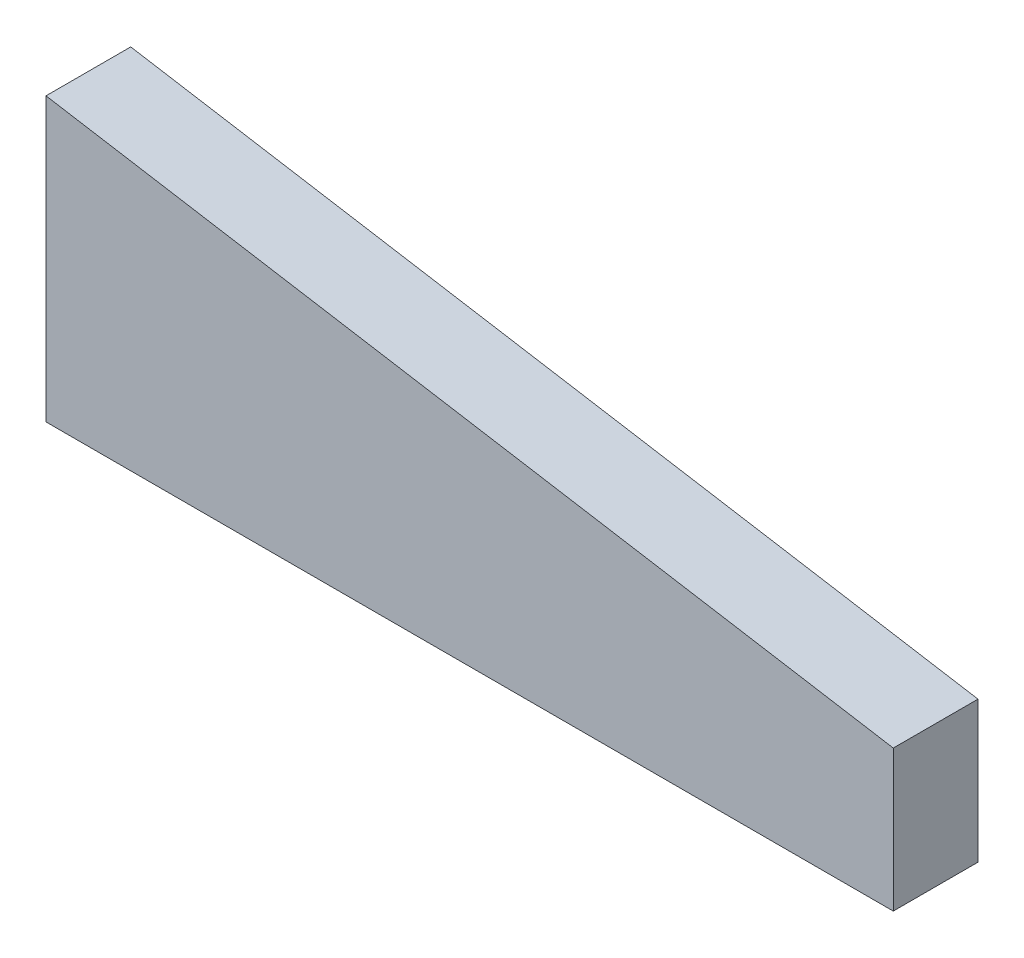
from build123d import *

# Parameters (mm, degrees)
BOSS_EXTRU_1_DEPTH = 3


with BuildPart() as part:
    # Esquisse1 → Boss.-Extru.1 (new body)
    with BuildSketch(Plane.XY):
        Polygon((15, 0), (-15, 5), (-15, -5), (15, -5), align=None)
    extrude(amount=BOSS_EXTRU_1_DEPTH)


solid = part.part
